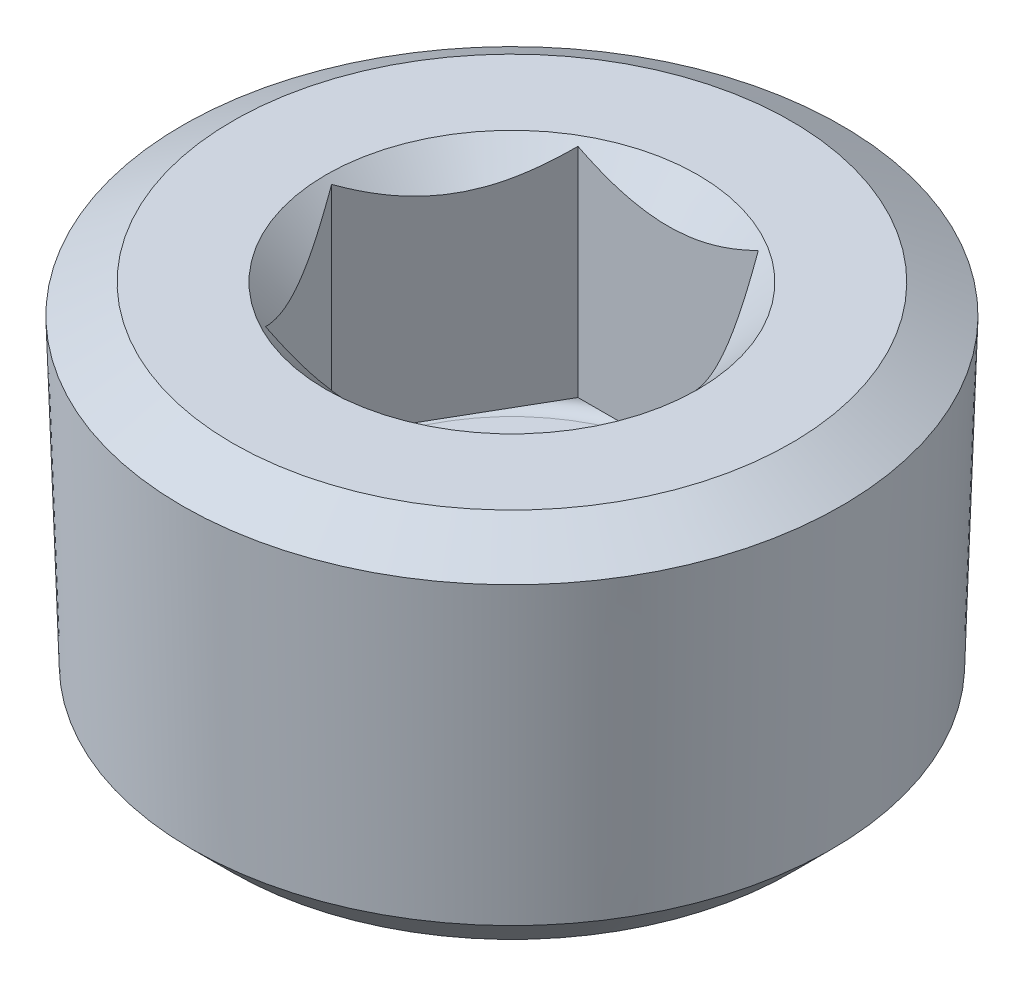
from build123d import *

# Parameters (mm, degrees)
CUT_EXTRUDE1_START = -11.43
CUT_EXTRUDE1_DEPTH = 11.143759


with BuildPart() as part:
    # Sketch2 → Revolve1 (revolve)
    with BuildSketch(Plane.XY, mode=Mode.PRIVATE) as revolve1_sk:
        Polygon((0, 0), (-14.302423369, 0), (-16.882597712, -1.489664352), (-16.399899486, -16.952523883), (-14.302423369, -19.05), (0, -19.05), align=None)
    revolve(revolve1_sk.sketch.rotate(Axis((0, 10.744282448, 0), (0, -1, 0)), 270), axis=Axis((0, 10.744282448, 0), (0, -1, 0)))

    # Sketch3 → Cut-Revolve1 (revolve, cut)
    with BuildSketch(Plane.XY, mode=Mode.PRIVATE) as cut_revolve1_sk:
        with BuildLine():
            Line((0, 0), (-9.525, 0))
            Line((-9.525, 0), (-8.001, -1.524))
            Line((-8.001, -1.524), (-8.001, -11.43))
            Line((-8.001, -11.43), (-9.525, -11.43))
            ThreePointArc((-9.525, -11.43), (-10.16, -12.065), (-9.525, -12.7))
            Line((-9.525, -12.7), (0, -12.7))
            Line((0, -12.7), (0, 0))
        make_face()
    revolve(cut_revolve1_sk.sketch.rotate(Axis((0, 2.934222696, 0), (0, -1, 0)), 270), axis=Axis((0, 2.934222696, 0), (0, -1, 0)), mode=Mode.SUBTRACT)

    # Sketch4 → Cut-Extrude1 (cut)
    with BuildSketch(Plane(origin=(0, 0, 0), x_dir=(1, 0, 0), z_dir=(0, 1, 0)).offset(CUT_EXTRUDE1_START)):
        Polygon((-4.619379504, -8.001), (4.619379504, -8.001), (9.238759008, 0), (4.619379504, 8.001), (-4.619379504, 8.001), (-9.238759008, 0), align=None)
    extrude(amount=CUT_EXTRUDE1_DEPTH, mode=Mode.SUBTRACT)


solid = part.part
